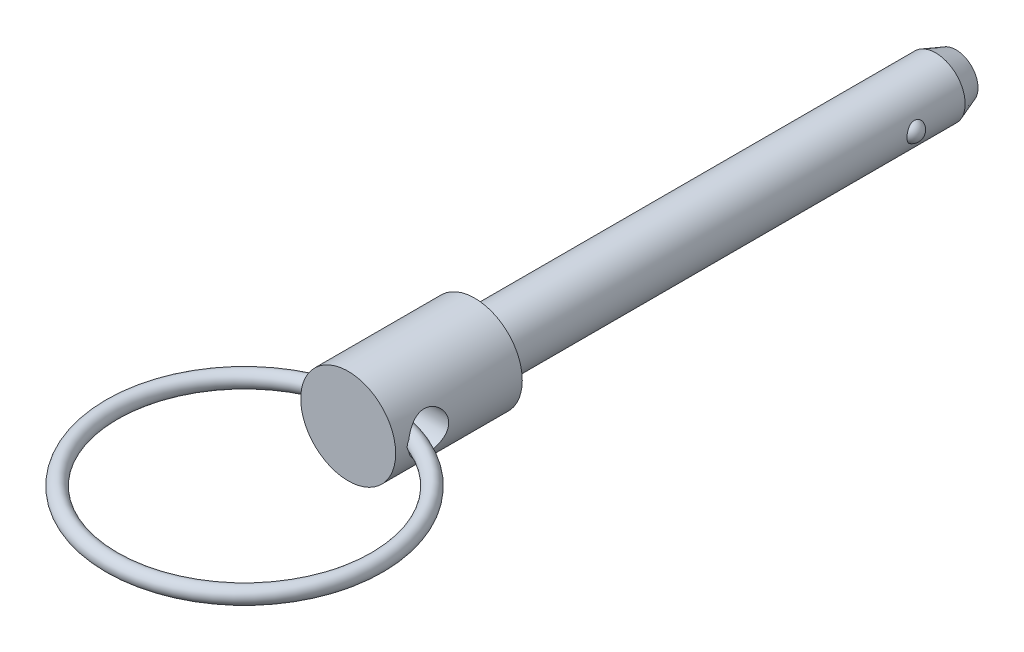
ISO-10303-21;
HEADER;
FILE_DESCRIPTION(('STEP AP214'),'2;1');
FILE_NAME('part.step','',(''),(''),'','','');
FILE_SCHEMA(('AUTOMOTIVE_DESIGN { 1 0 10303 214 1 1 1 1 }'));
ENDSEC;
DATA;
#1=APPLICATION_CONTEXT('core data for automotive mechanical design processes');
#2=APPLICATION_PROTOCOL_DEFINITION('international standard','automotive_design',2000,#1);
#3=PRODUCT_CONTEXT('',#1,'mechanical');
#4=PRODUCT('Part','Part','',(#3));
#5=PRODUCT_RELATED_PRODUCT_CATEGORY('part','',(#4));
#6=PRODUCT_DEFINITION_FORMATION('','',#4);
#7=PRODUCT_DEFINITION_CONTEXT('part definition',#1,'design');
#8=PRODUCT_DEFINITION('design','',#6,#7);
#9=PRODUCT_DEFINITION_SHAPE('','',#8);
#10=(LENGTH_UNIT() NAMED_UNIT(*) SI_UNIT(.MILLI.,.METRE.));
#11=(NAMED_UNIT(*) PLANE_ANGLE_UNIT() SI_UNIT($,.RADIAN.));
#12=(NAMED_UNIT(*) SI_UNIT($,.STERADIAN.) SOLID_ANGLE_UNIT());
#13=UNCERTAINTY_MEASURE_WITH_UNIT(LENGTH_MEASURE(1.E-05),#10,'distance_accuracy_value','');
#14=(GEOMETRIC_REPRESENTATION_CONTEXT(3) GLOBAL_UNCERTAINTY_ASSIGNED_CONTEXT((#13)) GLOBAL_UNIT_ASSIGNED_CONTEXT((#10,
#11,#12)) REPRESENTATION_CONTEXT('',''));
#15=CARTESIAN_POINT('',(0.,0.,0.));
#16=DIRECTION('',(0.,0.,1.));
#17=DIRECTION('',(1.,0.,0.));
#18=AXIS2_PLACEMENT_3D('',#15,#16,#17);
#19=CARTESIAN_POINT('',(6.35,0.,9.398));
#20=DIRECTION('',(-1.,0.,0.));
#21=DIRECTION('',(0.,0.,-1.));
#22=AXIS2_PLACEMENT_3D('',#19,#20,#21);
#23=CYLINDRICAL_SURFACE('',#22,2.0193);
#24=CARTESIAN_POINT('',(-4.76270000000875,0.49815316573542,11.3548893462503));
#25=CARTESIAN_POINT('',(-4.72833190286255,0.47504859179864,11.3607446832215));
#26=CARTESIAN_POINT('',(-4.69505034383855,0.4499197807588,11.3667299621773));
#27=CARTESIAN_POINT('',(-4.63192457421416,0.394832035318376,11.3785339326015));
#28=CARTESIAN_POINT('',(-4.6021351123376,0.364810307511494,11.3843491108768));
#29=CARTESIAN_POINT('',(-4.55535458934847,0.308281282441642,11.3937756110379));
#30=CARTESIAN_POINT('',(-4.53705372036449,0.282907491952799,11.3975656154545));
#31=CARTESIAN_POINT('',(-4.50470768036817,0.229597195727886,11.4043835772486));
#32=CARTESIAN_POINT('',(-4.49064226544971,0.201673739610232,11.4074151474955));
#33=CARTESIAN_POINT('',(-4.46975490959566,0.148629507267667,11.4119668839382));
#34=CARTESIAN_POINT('',(-4.46210314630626,0.123852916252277,11.413657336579));
#35=CARTESIAN_POINT('',(-4.45097170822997,0.0733134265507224,11.4161269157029));
#36=CARTESIAN_POINT('',(-4.44749221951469,0.0475504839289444,11.4169060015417));
#37=CARTESIAN_POINT('',(-4.44500621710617,-0.00425946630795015,11.4174619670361));
#38=CARTESIAN_POINT('',(-4.44600914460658,-0.0303069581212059,11.4172367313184));
#39=CARTESIAN_POINT('',(-4.45241947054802,-0.0818207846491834,11.4158064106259));
#40=CARTESIAN_POINT('',(-4.45782777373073,-0.107286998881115,11.414601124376));
#41=CARTESIAN_POINT('',(-4.4724084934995,-0.156294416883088,11.4113883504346));
#42=CARTESIAN_POINT('',(-4.48147591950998,-0.179868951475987,11.4094032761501));
#43=CARTESIAN_POINT('',(-4.50279050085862,-0.2254541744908,11.404805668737));
#44=CARTESIAN_POINT('',(-4.51503925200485,-0.247464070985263,11.4021928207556));
#45=CARTESIAN_POINT('',(-4.55011891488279,-0.302206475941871,11.394845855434));
#46=CARTESIAN_POINT('',(-4.5749339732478,-0.333621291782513,11.3897686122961));
#47=CARTESIAN_POINT('',(-4.62912866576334,-0.392111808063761,11.3790894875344));
#48=CARTESIAN_POINT('',(-4.65852008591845,-0.419175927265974,11.3734862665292));
#49=CARTESIAN_POINT('',(-4.71307862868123,-0.4633355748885,11.3635175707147));
#50=CARTESIAN_POINT('',(-4.73757440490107,-0.481267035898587,11.3591766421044));
#51=CARTESIAN_POINT('',(-4.76270000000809,-0.498153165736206,11.3548893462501));
#52=B_SPLINE_CURVE_WITH_KNOTS('',3,(#24,#25,#26,#27,#28,#29,#30,#31,#32,#33,#34,#35,#36,#37,#38,
#39,#40,#41,#42,#43,#44,#45,#46,#47,#48,#49,#50,#51),.UNSPECIFIED.,.F.,.F.,(4,2,2,2,2,2,2,2,2,2,
2,2,2,4),(0.,0.125801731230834,0.253367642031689,0.34757949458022,0.441333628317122,
0.518959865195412,0.596589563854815,0.674382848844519,0.752192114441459,0.827911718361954,
0.903669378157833,1.02403641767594,1.14471874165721,1.23653238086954),.UNSPECIFIED.);
#53=CARTESIAN_POINT('',(-4.73813099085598,0.481166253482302,11.3591352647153));
#54=VERTEX_POINT('',#53);
#55=CARTESIAN_POINT('',(-4.73813099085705,-0.481166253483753,11.359135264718));
#56=VERTEX_POINT('',#55);
#57=EDGE_CURVE('E40',#54,#56,#52,.T.);
#58=ORIENTED_EDGE('',*,*,#57,.F.);
#59=CARTESIAN_POINT('',(-4.7625,0.,11.4173));
#60=CARTESIAN_POINT('',(-4.76249489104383,-0.108112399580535,11.4172937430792));
#61=CARTESIAN_POINT('',(-4.75878025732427,-0.216312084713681,11.408574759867));
#62=CARTESIAN_POINT('',(-4.74429807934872,-0.429541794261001,11.3740482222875));
#63=CARTESIAN_POINT('',(-4.73352107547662,-0.534567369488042,11.3482177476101));
#64=CARTESIAN_POINT('',(-4.70606638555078,-0.738151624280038,11.2805979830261));
#65=CARTESIAN_POINT('',(-4.68940628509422,-0.836728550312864,11.2388562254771));
#66=CARTESIAN_POINT('',(-4.65179514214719,-1.02541561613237,11.1408163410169));
#67=CARTESIAN_POINT('',(-4.63084399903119,-1.11552555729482,11.0845178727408));
#68=CARTESIAN_POINT('',(-4.58553515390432,-1.28946876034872,10.9559107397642));
#69=CARTESIAN_POINT('',(-4.56106355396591,-1.37280723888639,10.8829734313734));
#70=CARTESIAN_POINT('',(-4.51195602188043,-1.52649281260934,10.7244940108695));
#71=CARTESIAN_POINT('',(-4.48732001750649,-1.5968337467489,10.6389459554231));
#72=CARTESIAN_POINT('',(-4.43925108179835,-1.72611165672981,10.4523438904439));
#73=CARTESIAN_POINT('',(-4.41594507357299,-1.78427664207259,10.3507188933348));
#74=CARTESIAN_POINT('',(-4.3749946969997,-1.88246618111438,10.1379969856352));
#75=CARTESIAN_POINT('',(-4.35734737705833,-1.92250019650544,10.0269050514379));
#76=CARTESIAN_POINT('',(-4.33095312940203,-1.98122376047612,9.8041136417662));
#77=CARTESIAN_POINT('',(-4.32180970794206,-2.00086973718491,9.69271508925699));
#78=CARTESIAN_POINT('',(-4.31232297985,-2.02124136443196,9.46785625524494));
#79=CARTESIAN_POINT('',(-4.31197457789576,-2.02197796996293,9.35439720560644));
#80=CARTESIAN_POINT('',(-4.31978298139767,-2.00522830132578,9.13832342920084));
#81=CARTESIAN_POINT('',(-4.32726229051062,-1.98919366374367,9.03556669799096));
#82=CARTESIAN_POINT('',(-4.34873498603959,-1.94179810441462,8.83436976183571));
#83=CARTESIAN_POINT('',(-4.36272967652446,-1.91043411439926,8.73593042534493));
#84=CARTESIAN_POINT('',(-4.39597564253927,-1.83265370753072,8.54363008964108));
#85=CARTESIAN_POINT('',(-4.41533413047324,-1.78592620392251,8.44991428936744));
#86=CARTESIAN_POINT('',(-4.45710273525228,-1.67896759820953,8.27128429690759));
#87=CARTESIAN_POINT('',(-4.47951396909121,-1.61873154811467,8.1863733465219));
#88=CARTESIAN_POINT('',(-4.52725353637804,-1.48026834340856,8.0199216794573));
#89=CARTESIAN_POINT('',(-4.55266534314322,-1.40092677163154,7.93932933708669));
#90=CARTESIAN_POINT('',(-4.6018976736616,-1.22958667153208,7.79224755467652));
#91=CARTESIAN_POINT('',(-4.62571737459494,-1.13758167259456,7.72576536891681));
#92=CARTESIAN_POINT('',(-4.66982369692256,-0.940529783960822,7.60732387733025));
#93=CARTESIAN_POINT('',(-4.69000583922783,-0.835212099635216,7.55577397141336));
#94=CARTESIAN_POINT('',(-4.72372878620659,-0.616416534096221,7.47153070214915));
#95=CARTESIAN_POINT('',(-4.73728278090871,-0.502955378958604,7.43879986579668));
#96=CARTESIAN_POINT('',(-4.75192155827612,-0.323662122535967,7.40374908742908));
#97=CARTESIAN_POINT('',(-4.75587275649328,-0.259363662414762,7.39437239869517));
#98=CARTESIAN_POINT('',(-4.76116348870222,-0.130053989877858,7.3818460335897));
#99=CARTESIAN_POINT('',(-4.76250307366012,-0.0650427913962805,7.37869623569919));
#100=CARTESIAN_POINT('',(-4.76249489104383,0.108112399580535,7.37870625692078));
#101=CARTESIAN_POINT('',(-4.75878025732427,0.21631208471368,7.38742524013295));
#102=CARTESIAN_POINT('',(-4.74429807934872,0.429541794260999,7.42195177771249));
#103=CARTESIAN_POINT('',(-4.73352107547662,0.534567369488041,7.44778225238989));
#104=CARTESIAN_POINT('',(-4.70606638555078,0.738151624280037,7.51540201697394));
#105=CARTESIAN_POINT('',(-4.68940628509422,0.836728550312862,7.55714377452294));
#106=CARTESIAN_POINT('',(-4.65179514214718,1.02541561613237,7.65518365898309));
#107=CARTESIAN_POINT('',(-4.63084399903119,1.11552555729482,7.71148212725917));
#108=CARTESIAN_POINT('',(-4.58553515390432,1.28946876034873,7.8400892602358));
#109=CARTESIAN_POINT('',(-4.56106355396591,1.37280723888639,7.91302656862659));
#110=CARTESIAN_POINT('',(-4.51195602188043,1.52649281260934,8.07150598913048));
#111=CARTESIAN_POINT('',(-4.48732001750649,1.5968337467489,8.15705404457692));
#112=CARTESIAN_POINT('',(-4.43925108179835,1.72611165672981,8.34365610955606));
#113=CARTESIAN_POINT('',(-4.41594507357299,1.78427664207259,8.44528110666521));
#114=CARTESIAN_POINT('',(-4.3749946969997,1.88246618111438,8.65800301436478));
#115=CARTESIAN_POINT('',(-4.35734737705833,1.92250019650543,8.76909494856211));
#116=CARTESIAN_POINT('',(-4.33095312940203,1.98122376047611,8.99188635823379));
#117=CARTESIAN_POINT('',(-4.32180970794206,2.00086973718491,9.103284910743));
#118=CARTESIAN_POINT('',(-4.31232297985,2.02124136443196,9.32814374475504));
#119=CARTESIAN_POINT('',(-4.31197457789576,2.02197796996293,9.44160279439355));
#120=CARTESIAN_POINT('',(-4.31978298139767,2.00522830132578,9.65767657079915));
#121=CARTESIAN_POINT('',(-4.32726229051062,1.98919366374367,9.76043330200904));
#122=CARTESIAN_POINT('',(-4.34873498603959,1.94179810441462,9.96163023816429));
#123=CARTESIAN_POINT('',(-4.36272967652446,1.91043411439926,10.0600695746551));
#124=CARTESIAN_POINT('',(-4.39597564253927,1.83265370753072,10.2523699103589));
#125=CARTESIAN_POINT('',(-4.41533413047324,1.78592620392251,10.3460857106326));
#126=CARTESIAN_POINT('',(-4.45710273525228,1.67896759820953,10.5247157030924));
#127=CARTESIAN_POINT('',(-4.47951396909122,1.61873154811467,10.6096266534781));
#128=CARTESIAN_POINT('',(-4.52725353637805,1.48026834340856,10.7760783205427));
#129=CARTESIAN_POINT('',(-4.55266534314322,1.40092677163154,10.8566706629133));
#130=CARTESIAN_POINT('',(-4.6018976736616,1.22958667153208,11.0037524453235));
#131=CARTESIAN_POINT('',(-4.62571737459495,1.13758167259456,11.0702346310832));
#132=CARTESIAN_POINT('',(-4.66982369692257,0.940529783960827,11.1886761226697));
#133=CARTESIAN_POINT('',(-4.69000583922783,0.835212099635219,11.2402260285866));
#134=CARTESIAN_POINT('',(-4.72372878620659,0.616416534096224,11.3244692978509));
#135=CARTESIAN_POINT('',(-4.73728278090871,0.502955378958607,11.3572001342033));
#136=CARTESIAN_POINT('',(-4.75192155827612,0.323662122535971,11.3922509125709));
#137=CARTESIAN_POINT('',(-4.75587275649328,0.259363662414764,11.4016276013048));
#138=CARTESIAN_POINT('',(-4.76116348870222,0.130053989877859,11.4141539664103));
#139=CARTESIAN_POINT('',(-4.76250307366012,0.0650427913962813,11.4173037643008));
#140=CARTESIAN_POINT('',(-4.7625,0.,11.4173));
#141=B_SPLINE_CURVE_WITH_KNOTS('',3,(#59,#60,#61,#62,#63,#64,#65,#66,#67,#68,#69,#70,#71,#72,
#73,#74,#75,#76,#77,#78,#79,#80,#81,#82,#83,#84,#85,#86,#87,#88,#89,#90,#91,#92,#93,#94,#95,#96,
#97,#98,#99,#100,#101,#102,#103,#104,#105,#106,#107,#108,#109,#110,#111,#112,#113,#114,#115,
#116,#117,#118,#119,#120,#121,#122,#123,#124,#125,#126,#127,#128,#129,#130,#131,#132,#133,#134,
#135,#136,#137,#138,#139,#140),.UNSPECIFIED.,.T.,.F.,(4,2,2,2,2,2,2,2,2,2,2,2,2,2,2,2,2,2,2,2,2,
2,2,2,2,2,2,2,2,2,2,2,2,2,2,2,2,2,2,2,4),(0.,0.324084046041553,0.648603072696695,
0.972160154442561,1.29572482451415,1.63451297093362,1.97346129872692,2.32983137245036,
2.68601525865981,3.0246096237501,3.3630078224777,3.67436181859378,3.98577815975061,
4.30393445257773,4.6222074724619,4.96838833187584,5.31474674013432,5.66985671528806,
6.02425711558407,6.21923699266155,6.41421306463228,6.73829711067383,7.06281613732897,
7.38637321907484,7.70993788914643,8.0487260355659,8.38767436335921,8.74404443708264,
9.10022832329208,9.43882268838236,9.77722088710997,10.0885748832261,10.3999912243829,
10.71814751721,11.0364205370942,11.3826013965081,11.7289598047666,12.0840697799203,
12.4384701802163,12.6334500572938,12.8284261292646),.UNSPECIFIED.);
#142=EDGE_CURVE('E54',#56,#54,#141,.T.);
#143=ORIENTED_EDGE('',*,*,#142,.F.);
#144=EDGE_LOOP('',(#58,#143));
#145=FACE_BOUND('',#144,.T.);
#146=CARTESIAN_POINT('',(4.76270000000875,-0.498153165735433,11.3548893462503));
#147=CARTESIAN_POINT('',(4.72833190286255,-0.475048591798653,11.3607446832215));
#148=CARTESIAN_POINT('',(4.69505034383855,-0.449919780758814,11.3667299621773));
#149=CARTESIAN_POINT('',(4.63192457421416,-0.394832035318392,11.3785339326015));
#150=CARTESIAN_POINT('',(4.6021351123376,-0.364810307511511,11.3843491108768));
#151=CARTESIAN_POINT('',(4.55535458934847,-0.30828128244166,11.3937756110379));
#152=CARTESIAN_POINT('',(4.53705372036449,-0.282907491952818,11.3975656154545));
#153=CARTESIAN_POINT('',(4.50470768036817,-0.229597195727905,11.4043835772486));
#154=CARTESIAN_POINT('',(4.49064226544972,-0.20167373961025,11.4074151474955));
#155=CARTESIAN_POINT('',(4.46975490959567,-0.148629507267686,11.4119668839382));
#156=CARTESIAN_POINT('',(4.46210314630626,-0.123852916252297,11.413657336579));
#157=CARTESIAN_POINT('',(4.45097170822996,-0.0733134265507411,11.4161269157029));
#158=CARTESIAN_POINT('',(4.44749221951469,-0.0475504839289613,11.4169060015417));
#159=CARTESIAN_POINT('',(4.44500621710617,0.00425946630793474,11.4174619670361));
#160=CARTESIAN_POINT('',(4.44600914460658,0.0303069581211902,11.4172367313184));
#161=CARTESIAN_POINT('',(4.45241947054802,0.081820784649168,11.4158064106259));
#162=CARTESIAN_POINT('',(4.45782777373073,0.1072869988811,11.414601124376));
#163=CARTESIAN_POINT('',(4.4724084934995,0.156294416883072,11.4113883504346));
#164=CARTESIAN_POINT('',(4.48147591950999,0.17986895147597,11.4094032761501));
#165=CARTESIAN_POINT('',(4.50279050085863,0.225454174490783,11.404805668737));
#166=CARTESIAN_POINT('',(4.51503925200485,0.247464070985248,11.4021928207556));
#167=CARTESIAN_POINT('',(4.55011891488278,0.302206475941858,11.394845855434));
#168=CARTESIAN_POINT('',(4.5749339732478,0.3336212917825,11.3897686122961));
#169=CARTESIAN_POINT('',(4.62912866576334,0.39211180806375,11.3790894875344));
#170=CARTESIAN_POINT('',(4.65852008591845,0.419175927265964,11.3734862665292));
#171=CARTESIAN_POINT('',(4.71307862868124,0.463335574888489,11.3635175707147));
#172=CARTESIAN_POINT('',(4.73757440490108,0.481267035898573,11.3591766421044));
#173=CARTESIAN_POINT('',(4.76270000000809,0.498153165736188,11.3548893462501));
#174=B_SPLINE_CURVE_WITH_KNOTS('',3,(#146,#147,#148,#149,#150,#151,#152,#153,#154,#155,#156,
#157,#158,#159,#160,#161,#162,#163,#164,#165,#166,#167,#168,#169,#170,#171,#172,#173),
.UNSPECIFIED.,.F.,.F.,(4,2,2,2,2,2,2,2,2,2,2,2,2,4),(0.,0.125801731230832,0.253367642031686,
0.347579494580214,0.441333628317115,0.518959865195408,0.596589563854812,0.674382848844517,
0.752192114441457,0.827911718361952,0.90366937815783,1.02403641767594,1.14471874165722,
1.23653238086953),.UNSPECIFIED.);
#175=CARTESIAN_POINT('',(4.73813099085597,-0.481166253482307,11.3591352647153));
#176=VERTEX_POINT('',#175);
#177=CARTESIAN_POINT('',(4.73813099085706,0.481166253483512,11.359135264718));
#178=VERTEX_POINT('',#177);
#179=EDGE_CURVE('E33',#176,#178,#174,.T.);
#180=ORIENTED_EDGE('',*,*,#179,.F.);
#181=CARTESIAN_POINT('',(4.7625,0.,7.3787));
#182=CARTESIAN_POINT('',(4.76249489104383,-0.108112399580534,7.37870625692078));
#183=CARTESIAN_POINT('',(4.75878025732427,-0.216312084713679,7.38742524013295));
#184=CARTESIAN_POINT('',(4.7442980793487,-0.429541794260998,7.42195177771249));
#185=CARTESIAN_POINT('',(4.7335210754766,-0.53456736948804,7.44778225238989));
#186=CARTESIAN_POINT('',(4.70606638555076,-0.738151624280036,7.51540201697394));
#187=CARTESIAN_POINT('',(4.6894062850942,-0.836728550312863,7.55714377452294));
#188=CARTESIAN_POINT('',(4.65179514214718,-1.02541561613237,7.65518365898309));
#189=CARTESIAN_POINT('',(4.63084399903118,-1.11552555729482,7.71148212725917));
#190=CARTESIAN_POINT('',(4.58553515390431,-1.28946876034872,7.8400892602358));
#191=CARTESIAN_POINT('',(4.5610635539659,-1.37280723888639,7.91302656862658));
#192=CARTESIAN_POINT('',(4.51195602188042,-1.52649281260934,8.07150598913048));
#193=CARTESIAN_POINT('',(4.48732001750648,-1.59683374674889,8.15705404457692));
#194=CARTESIAN_POINT('',(4.43925108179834,-1.7261116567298,8.34365610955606));
#195=CARTESIAN_POINT('',(4.41594507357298,-1.78427664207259,8.44528110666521));
#196=CARTESIAN_POINT('',(4.37499469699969,-1.88246618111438,8.65800301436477));
#197=CARTESIAN_POINT('',(4.35734737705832,-1.92250019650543,8.76909494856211));
#198=CARTESIAN_POINT('',(4.33095312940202,-1.98122376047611,8.99188635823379));
#199=CARTESIAN_POINT('',(4.32180970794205,-2.0008697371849,9.103284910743));
#200=CARTESIAN_POINT('',(4.31232297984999,-2.02124136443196,9.32814374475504));
#201=CARTESIAN_POINT('',(4.31197457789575,-2.02197796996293,9.44160279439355));
#202=CARTESIAN_POINT('',(4.31978298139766,-2.00522830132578,9.65767657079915));
#203=CARTESIAN_POINT('',(4.3272622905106,-1.98919366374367,9.76043330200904));
#204=CARTESIAN_POINT('',(4.34873498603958,-1.94179810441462,9.96163023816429));
#205=CARTESIAN_POINT('',(4.36272967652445,-1.91043411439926,10.0600695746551));
#206=CARTESIAN_POINT('',(4.39597564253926,-1.83265370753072,10.2523699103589));
#207=CARTESIAN_POINT('',(4.41533413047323,-1.78592620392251,10.3460857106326));
#208=CARTESIAN_POINT('',(4.45710273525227,-1.67896759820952,10.5247157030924));
#209=CARTESIAN_POINT('',(4.4795139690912,-1.61873154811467,10.6096266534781));
#210=CARTESIAN_POINT('',(4.52725353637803,-1.48026834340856,10.7760783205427));
#211=CARTESIAN_POINT('',(4.55266534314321,-1.40092677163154,10.8566706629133));
#212=CARTESIAN_POINT('',(4.60189767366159,-1.22958667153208,11.0037524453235));
#213=CARTESIAN_POINT('',(4.62571737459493,-1.13758167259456,11.0702346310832));
#214=CARTESIAN_POINT('',(4.66982369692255,-0.940529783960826,11.1886761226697));
#215=CARTESIAN_POINT('',(4.69000583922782,-0.835212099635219,11.2402260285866));
#216=CARTESIAN_POINT('',(4.72372878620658,-0.616416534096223,11.3244692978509));
#217=CARTESIAN_POINT('',(4.7372827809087,-0.502955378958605,11.3572001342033));
#218=CARTESIAN_POINT('',(4.7519215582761,-0.323662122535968,11.3922509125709));
#219=CARTESIAN_POINT('',(4.75587275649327,-0.259363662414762,11.4016276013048));
#220=CARTESIAN_POINT('',(4.76116348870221,-0.130053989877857,11.4141539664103));
#221=CARTESIAN_POINT('',(4.76250307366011,-0.0650427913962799,11.4173037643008));
#222=CARTESIAN_POINT('',(4.76249489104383,0.108112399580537,11.4172937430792));
#223=CARTESIAN_POINT('',(4.75878025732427,0.216312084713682,11.408574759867));
#224=CARTESIAN_POINT('',(4.7442980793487,0.429541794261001,11.3740482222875));
#225=CARTESIAN_POINT('',(4.7335210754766,0.534567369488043,11.3482177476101));
#226=CARTESIAN_POINT('',(4.70606638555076,0.738151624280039,11.2805979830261));
#227=CARTESIAN_POINT('',(4.6894062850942,0.836728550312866,11.2388562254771));
#228=CARTESIAN_POINT('',(4.65179514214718,1.02541561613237,11.1408163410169));
#229=CARTESIAN_POINT('',(4.63084399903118,1.11552555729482,11.0845178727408));
#230=CARTESIAN_POINT('',(4.58553515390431,1.28946876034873,10.9559107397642));
#231=CARTESIAN_POINT('',(4.5610635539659,1.37280723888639,10.8829734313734));
#232=CARTESIAN_POINT('',(4.51195602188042,1.52649281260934,10.7244940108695));
#233=CARTESIAN_POINT('',(4.48732001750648,1.5968337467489,10.6389459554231));
#234=CARTESIAN_POINT('',(4.43925108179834,1.72611165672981,10.4523438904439));
#235=CARTESIAN_POINT('',(4.41594507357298,1.78427664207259,10.3507188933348));
#236=CARTESIAN_POINT('',(4.37499469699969,1.88246618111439,10.1379969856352));
#237=CARTESIAN_POINT('',(4.35734737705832,1.92250019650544,10.0269050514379));
#238=CARTESIAN_POINT('',(4.33095312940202,1.98122376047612,9.8041136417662));
#239=CARTESIAN_POINT('',(4.32180970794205,2.00086973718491,9.69271508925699));
#240=CARTESIAN_POINT('',(4.31232297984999,2.02124136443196,9.46785625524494));
#241=CARTESIAN_POINT('',(4.31197457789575,2.02197796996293,9.35439720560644));
#242=CARTESIAN_POINT('',(4.31978298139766,2.00522830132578,9.13832342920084));
#243=CARTESIAN_POINT('',(4.32726229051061,1.98919366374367,9.03556669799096));
#244=CARTESIAN_POINT('',(4.34873498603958,1.94179810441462,8.83436976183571));
#245=CARTESIAN_POINT('',(4.36272967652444,1.91043411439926,8.73593042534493));
#246=CARTESIAN_POINT('',(4.39597564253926,1.83265370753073,8.54363008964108));
#247=CARTESIAN_POINT('',(4.41533413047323,1.78592620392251,8.44991428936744));
#248=CARTESIAN_POINT('',(4.45710273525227,1.67896759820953,8.27128429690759));
#249=CARTESIAN_POINT('',(4.4795139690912,1.61873154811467,8.1863733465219));
#250=CARTESIAN_POINT('',(4.52725353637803,1.48026834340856,8.0199216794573));
#251=CARTESIAN_POINT('',(4.55266534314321,1.40092677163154,7.93932933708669));
#252=CARTESIAN_POINT('',(4.60189767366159,1.22958667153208,7.79224755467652));
#253=CARTESIAN_POINT('',(4.62571737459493,1.13758167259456,7.72576536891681));
#254=CARTESIAN_POINT('',(4.66982369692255,0.940529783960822,7.60732387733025));
#255=CARTESIAN_POINT('',(4.69000583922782,0.835212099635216,7.55577397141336));
#256=CARTESIAN_POINT('',(4.72372878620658,0.616416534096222,7.47153070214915));
#257=CARTESIAN_POINT('',(4.7372827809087,0.502955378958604,7.43879986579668));
#258=CARTESIAN_POINT('',(4.7519215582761,0.323662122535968,7.40374908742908));
#259=CARTESIAN_POINT('',(4.75587275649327,0.259363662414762,7.39437239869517));
#260=CARTESIAN_POINT('',(4.76116348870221,0.130053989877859,7.3818460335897));
#261=CARTESIAN_POINT('',(4.76250307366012,0.0650427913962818,7.37869623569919));
#262=CARTESIAN_POINT('',(4.7625,0.,7.3787));
#263=B_SPLINE_CURVE_WITH_KNOTS('',3,(#181,#182,#183,#184,#185,#186,#187,#188,#189,#190,#191,
#192,#193,#194,#195,#196,#197,#198,#199,#200,#201,#202,#203,#204,#205,#206,#207,#208,#209,#210,
#211,#212,#213,#214,#215,#216,#217,#218,#219,#220,#221,#222,#223,#224,#225,#226,#227,#228,#229,
#230,#231,#232,#233,#234,#235,#236,#237,#238,#239,#240,#241,#242,#243,#244,#245,#246,#247,#248,
#249,#250,#251,#252,#253,#254,#255,#256,#257,#258,#259,#260,#261,#262),.UNSPECIFIED.,.T.,.F.,(4,
2,2,2,2,2,2,2,2,2,2,2,2,2,2,2,2,2,2,2,2,2,2,2,2,2,2,2,2,2,2,2,2,2,2,2,2,2,2,2,4),(0.,
0.324084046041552,0.648603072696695,0.972160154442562,1.29572482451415,1.63451297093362,
1.97346129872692,2.32983137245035,2.6860152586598,3.02460962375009,3.36300782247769,
3.67436181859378,3.98577815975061,4.30393445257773,4.6222074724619,4.96838833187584,
5.31474674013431,5.66985671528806,6.02425711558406,6.21923699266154,6.41421306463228,
6.73829711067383,7.06281613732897,7.38637321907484,7.70993788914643,8.0487260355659,
8.3876743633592,8.74404443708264,9.10022832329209,9.43882268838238,9.77722088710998,
10.0885748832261,10.3999912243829,10.71814751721,11.0364205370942,11.3826013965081,
11.7289598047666,12.0840697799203,12.4384701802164,12.6334500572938,12.8284261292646),.UNSPECIFIED.);
#264=EDGE_CURVE('E50',#178,#176,#263,.T.);
#265=ORIENTED_EDGE('',*,*,#264,.F.);
#266=EDGE_LOOP('',(#180,#265));
#267=FACE_BOUND('',#266,.T.);
#268=ADVANCED_FACE('F14',(#145,#267),#23,.F.);
#269=CARTESIAN_POINT('',(0.,0.,-23.2664));
#270=DIRECTION('',(0.,0.,-1.));
#271=DIRECTION('',(1.,0.,0.));
#272=AXIS2_PLACEMENT_3D('',#269,#270,#271);
#273=CYLINDRICAL_SURFACE('',#272,4.7625);
#274=ORIENTED_EDGE('',*,*,#264,.T.);
#275=CARTESIAN_POINT('',(4.75672783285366,-0.234410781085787,9.86389096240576));
#276=CARTESIAN_POINT('',(4.75463715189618,-0.276823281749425,9.87695364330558));
#277=CARTESIAN_POINT('',(4.75202741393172,-0.318142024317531,9.89358560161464));
#278=CARTESIAN_POINT('',(4.74605906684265,-0.397384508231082,9.93354154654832));
#279=CARTESIAN_POINT('',(4.74269965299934,-0.435304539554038,9.95687273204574));
#280=CARTESIAN_POINT('',(4.7356117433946,-0.506628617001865,10.0095466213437));
#281=CARTESIAN_POINT('',(4.731883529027,-0.540036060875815,10.0388847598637));
#282=CARTESIAN_POINT('',(4.72446904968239,-0.601463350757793,10.1027270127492));
#283=CARTESIAN_POINT('',(4.72078277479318,-0.629484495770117,10.1372298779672));
#284=CARTESIAN_POINT('',(4.71381973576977,-0.679675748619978,10.2106969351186));
#285=CARTESIAN_POINT('',(4.71054647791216,-0.701797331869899,10.2496945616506));
#286=CARTESIAN_POINT('',(4.70478201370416,-0.739457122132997,10.3307970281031));
#287=CARTESIAN_POINT('',(4.7022909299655,-0.754994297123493,10.3729023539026));
#288=CARTESIAN_POINT('',(4.69825743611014,-0.779709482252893,10.4605198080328));
#289=CARTESIAN_POINT('',(4.69674995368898,-0.788654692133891,10.5060989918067));
#290=CARTESIAN_POINT('',(4.694941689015,-0.799348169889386,10.5981124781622));
#291=CARTESIAN_POINT('',(4.69464124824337,-0.80109440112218,10.6445470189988));
#292=CARTESIAN_POINT('',(4.69525593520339,-0.797484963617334,10.7400273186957));
#293=CARTESIAN_POINT('',(4.6962479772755,-0.7916799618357,10.7890554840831));
#294=CARTESIAN_POINT('',(4.69943436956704,-0.772538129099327,10.88558205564));
#295=CARTESIAN_POINT('',(4.70162918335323,-0.759198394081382,10.9330798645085));
#296=CARTESIAN_POINT('',(4.7071366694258,-0.724294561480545,11.0283694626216));
#297=CARTESIAN_POINT('',(4.71051187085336,-0.702258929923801,11.0759856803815));
#298=CARTESIAN_POINT('',(4.71792781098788,-0.650571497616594,11.1668661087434));
#299=CARTESIAN_POINT('',(4.72196879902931,-0.620916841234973,11.2101286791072));
#300=CARTESIAN_POINT('',(4.73024120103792,-0.554392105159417,11.2909794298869));
#301=CARTESIAN_POINT('',(4.73447324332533,-0.517496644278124,11.3285468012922));
#302=CARTESIAN_POINT('',(4.74255290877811,-0.437280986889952,11.3961281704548));
#303=CARTESIAN_POINT('',(4.74640083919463,-0.393965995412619,11.4261482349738));
#304=CARTESIAN_POINT('',(4.75279848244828,-0.306647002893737,11.4743172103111));
#305=CARTESIAN_POINT('',(4.7554392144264,-0.263139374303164,11.4933494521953));
#306=CARTESIAN_POINT('',(4.75956072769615,-0.17321041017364,11.5225838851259));
#307=CARTESIAN_POINT('',(4.7610430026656,-0.126792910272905,11.5327974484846));
#308=CARTESIAN_POINT('',(4.76251214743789,-0.0392228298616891,11.5429046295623));
#309=CARTESIAN_POINT('',(4.76267454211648,0.00179015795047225,11.5440098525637));
#310=CARTESIAN_POINT('',(4.76194485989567,0.0833582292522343,11.5390051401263));
#311=CARTESIAN_POINT('',(4.76105302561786,0.123913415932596,11.5328968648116));
#312=CARTESIAN_POINT('',(4.75839052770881,0.20139070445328,11.5143023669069));
#313=CARTESIAN_POINT('',(4.75666474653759,0.238393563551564,11.5021410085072));
#314=CARTESIAN_POINT('',(4.75253498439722,0.310009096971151,11.4722173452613));
#315=CARTESIAN_POINT('',(4.75013086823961,0.344621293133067,11.4544539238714));
#316=CARTESIAN_POINT('',(4.74468244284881,0.413106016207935,11.4126354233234));
#317=CARTESIAN_POINT('',(4.74160529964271,0.446760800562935,11.3882294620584));
#318=CARTESIAN_POINT('',(4.73521429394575,0.510064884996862,11.3347169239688));
#319=CARTESIAN_POINT('',(4.73190032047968,0.53971228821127,11.3056081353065));
#320=CARTESIAN_POINT('',(4.72489226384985,0.598141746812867,11.2395451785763));
#321=CARTESIAN_POINT('',(4.72120374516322,0.626328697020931,11.2020637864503));
#322=CARTESIAN_POINT('',(4.71424234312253,0.676737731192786,11.1232450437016));
#323=CARTESIAN_POINT('',(4.71096968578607,0.698956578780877,11.0819056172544));
#324=CARTESIAN_POINT('',(4.70485086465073,0.739081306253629,10.9918449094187));
#325=CARTESIAN_POINT('',(4.70208579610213,0.756287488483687,10.9428045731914));
#326=CARTESIAN_POINT('',(4.69779376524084,0.782507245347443,10.8425158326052));
#327=CARTESIAN_POINT('',(4.69626707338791,0.79151903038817,10.7912669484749));
#328=CARTESIAN_POINT('',(4.69466144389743,0.80099052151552,10.6869325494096));
#329=CARTESIAN_POINT('',(4.69461132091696,0.801280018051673,10.6338307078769));
#330=CARTESIAN_POINT('',(4.69610058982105,0.792506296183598,10.5284214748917));
#331=CARTESIAN_POINT('',(4.69763938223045,0.783446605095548,10.4761137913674));
#332=CARTESIAN_POINT('',(4.70202301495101,0.756674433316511,10.3770218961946));
#333=CARTESIAN_POINT('',(4.70478816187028,0.739486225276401,10.3300928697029));
#334=CARTESIAN_POINT('',(4.71127399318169,0.696967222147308,10.2401511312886));
#335=CARTESIAN_POINT('',(4.71499427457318,0.671639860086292,10.1971367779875));
#336=CARTESIAN_POINT('',(4.72264431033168,0.615452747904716,10.1192841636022));
#337=CARTESIAN_POINT('',(4.72654308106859,0.585080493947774,10.0840903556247));
#338=CARTESIAN_POINT('',(4.73429341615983,0.51863947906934,10.0195645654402));
#339=CARTESIAN_POINT('',(4.73814499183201,0.482572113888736,9.99023115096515));
#340=CARTESIAN_POINT('',(4.74520575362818,0.407195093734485,9.93927752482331));
#341=CARTESIAN_POINT('',(4.74843306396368,0.368048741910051,9.91741780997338));
#342=CARTESIAN_POINT('',(4.75404590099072,0.286564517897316,9.88060848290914));
#343=CARTESIAN_POINT('',(4.75643129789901,0.24422615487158,9.86565993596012));
#344=CARTESIAN_POINT('',(4.76007108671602,0.158026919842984,9.8432015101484));
#345=CARTESIAN_POINT('',(4.76133640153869,0.114185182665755,9.8356197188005));
#346=CARTESIAN_POINT('',(4.76263391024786,0.0258666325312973,9.82784590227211));
#347=CARTESIAN_POINT('',(4.76266746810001,-0.0186094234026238,9.82764570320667));
#348=CARTESIAN_POINT('',(4.76170334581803,-0.0918724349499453,9.83342133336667));
#349=CARTESIAN_POINT('',(4.76105293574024,-0.120844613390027,9.83731729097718));
#350=CARTESIAN_POINT('',(4.75925240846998,-0.178172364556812,9.84825826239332));
#351=CARTESIAN_POINT('',(4.7581022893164,-0.206527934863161,9.85530328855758));
#352=CARTESIAN_POINT('',(4.75672783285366,-0.234410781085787,9.86389096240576));
#353=B_SPLINE_CURVE_WITH_KNOTS('',3,(#275,#276,#277,#278,#279,#280,#281,#282,#283,#284,#285,
#286,#287,#288,#289,#290,#291,#292,#293,#294,#295,#296,#297,#298,#299,#300,#301,#302,#303,#304,
#305,#306,#307,#308,#309,#310,#311,#312,#313,#314,#315,#316,#317,#318,#319,#320,#321,#322,#323,
#324,#325,#326,#327,#328,#329,#330,#331,#332,#333,#334,#335,#336,#337,#338,#339,#340,#341,#342,
#343,#344,#345,#346,#347,#348,#349,#350,#351,#352),.UNSPECIFIED.,.T.,.F.,(4,2,2,2,2,2,2,2,2,2,2,
2,2,2,2,2,2,2,2,2,2,2,2,2,2,2,2,2,2,2,2,2,2,2,2,2,2,2,4),(0.,0.133176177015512,
0.266496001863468,0.3997148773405,0.532901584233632,0.667152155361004,0.801423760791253,
0.940235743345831,1.07908699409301,1.2265907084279,1.37415131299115,1.53115159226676,
1.68821080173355,1.84583071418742,2.00332351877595,2.14516294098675,2.28681917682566,
2.4092664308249,2.53168551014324,2.64814679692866,2.76463131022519,2.88919364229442,
3.01381473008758,3.15436663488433,3.2949946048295,3.45041783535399,3.60587500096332,
3.76436388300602,3.92279299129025,4.07216500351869,4.22147409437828,4.36072714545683,
4.49994612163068,4.63415709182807,4.76838874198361,4.90129648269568,5.03405704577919,
5.12160944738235,5.20916219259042),.UNSPECIFIED.);
#354=EDGE_CURVE('E27',#176,#178,#353,.T.);
#355=ORIENTED_EDGE('',*,*,#354,.T.);
#356=EDGE_LOOP('',(#274,#355));
#357=FACE_BOUND('',#356,.T.);
#358=CARTESIAN_POINT('',(0.,0.,1.14006026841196E-11));
#359=DIRECTION('',(0.,0.,-1.));
#360=DIRECTION('',(1.,0.,0.));
#361=AXIS2_PLACEMENT_3D('',#358,#359,#360);
#362=CIRCLE('',#361,4.76249999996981);
#363=CARTESIAN_POINT('',(4.76249999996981,0.,1.14003927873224E-11));
#364=VERTEX_POINT('',#363);
#365=EDGE_CURVE('E59',#364,#364,#362,.T.);
#366=ORIENTED_EDGE('',*,*,#365,.F.);
#367=EDGE_LOOP('',(#366));
#368=FACE_BOUND('',#367,.T.);
#369=CARTESIAN_POINT('',(0.,0.,12.7000000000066));
#370=DIRECTION('',(0.,0.,-1.));
#371=DIRECTION('',(1.,0.,0.));
#372=AXIS2_PLACEMENT_3D('',#369,#370,#371);
#373=CIRCLE('',#372,4.76249999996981);
#374=CARTESIAN_POINT('',(4.7624999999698,0.,12.7000000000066));
#375=VERTEX_POINT('',#374);
#376=EDGE_CURVE('E135',#375,#375,#373,.T.);
#377=ORIENTED_EDGE('',*,*,#376,.T.);
#378=EDGE_LOOP('',(#377));
#379=FACE_BOUND('',#378,.T.);
#380=ORIENTED_EDGE('',*,*,#142,.T.);
#381=CARTESIAN_POINT('',(-4.75672783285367,-0.234410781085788,9.86389096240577));
#382=CARTESIAN_POINT('',(-4.75880797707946,-0.192184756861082,9.85088943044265));
#383=CARTESIAN_POINT('',(-4.76037619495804,-0.148820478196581,9.84140883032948));
#384=CARTESIAN_POINT('',(-4.76231114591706,-0.0610623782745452,9.8297605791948));
#385=CARTESIAN_POINT('',(-4.76267662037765,-0.0166675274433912,9.82760058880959));
#386=CARTESIAN_POINT('',(-4.76216356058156,0.07184476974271,9.83066350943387));
#387=CARTESIAN_POINT('',(-4.76128553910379,0.115962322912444,9.83588337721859));
#388=CARTESIAN_POINT('',(-4.75838343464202,0.2026716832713,9.85356395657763));
#389=CARTESIAN_POINT('',(-4.75635960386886,0.245263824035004,9.86602307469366));
#390=CARTESIAN_POINT('',(-4.75138989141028,0.327732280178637,9.89785096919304));
#391=CARTESIAN_POINT('',(-4.7484438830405,0.367608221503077,9.91722069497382));
#392=CARTESIAN_POINT('',(-4.74195662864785,0.443516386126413,9.96233891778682));
#393=CARTESIAN_POINT('',(-4.73841538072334,0.479548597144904,9.98808743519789));
#394=CARTESIAN_POINT('',(-4.73111995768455,0.54686530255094,10.0453065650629));
#395=CARTESIAN_POINT('',(-4.72736528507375,0.578138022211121,10.0767909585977));
#396=CARTESIAN_POINT('',(-4.72006096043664,0.635024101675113,10.1445276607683));
#397=CARTESIAN_POINT('',(-4.71651131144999,0.660637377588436,10.1807800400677));
#398=CARTESIAN_POINT('',(-4.70994476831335,0.705946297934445,10.2575433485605));
#399=CARTESIAN_POINT('',(-4.70693606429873,0.725553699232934,10.298106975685));
#400=CARTESIAN_POINT('',(-4.70181675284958,0.758021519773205,10.3818966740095));
#401=CARTESIAN_POINT('',(-4.69970628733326,0.770880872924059,10.4251231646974));
#402=CARTESIAN_POINT('',(-4.69650867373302,0.790134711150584,10.5148288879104));
#403=CARTESIAN_POINT('',(-4.69546563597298,0.796251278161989,10.5613691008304));
#404=CARTESIAN_POINT('',(-4.69462220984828,0.801207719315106,10.6548424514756));
#405=CARTESIAN_POINT('',(-4.69482220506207,0.800045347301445,10.7017757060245));
#406=CARTESIAN_POINT('',(-4.69645733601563,0.790392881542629,10.7979976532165));
#407=CARTESIAN_POINT('',(-4.69797327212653,0.781423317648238,10.8472368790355));
#408=CARTESIAN_POINT('',(-4.70214662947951,0.755902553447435,10.943667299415));
#409=CARTESIAN_POINT('',(-4.70480451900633,0.739348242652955,10.9908576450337));
#410=CARTESIAN_POINT('',(-4.71113533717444,0.697907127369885,11.0846488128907));
#411=CARTESIAN_POINT('',(-4.71485784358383,0.672595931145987,11.1310597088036));
#412=CARTESIAN_POINT('',(-4.72278864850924,0.614436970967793,11.2188860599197));
#413=CARTESIAN_POINT('',(-4.72699707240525,0.5815872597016,11.2603002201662));
#414=CARTESIAN_POINT('',(-4.73530162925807,0.50952624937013,11.3359421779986));
#415=CARTESIAN_POINT('',(-4.73939847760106,0.470426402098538,11.3702753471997));
#416=CARTESIAN_POINT('',(-4.74699023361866,0.386343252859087,11.4308675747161));
#417=CARTESIAN_POINT('',(-4.75048579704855,0.341366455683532,11.457135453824));
#418=CARTESIAN_POINT('',(-4.7559922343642,0.252376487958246,11.4974010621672));
#419=CARTESIAN_POINT('',(-4.75812829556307,0.208856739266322,11.5124686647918));
#420=CARTESIAN_POINT('',(-4.76120337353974,0.119700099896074,11.5339491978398));
#421=CARTESIAN_POINT('',(-4.76214369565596,0.0740655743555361,11.540371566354));
#422=CARTESIAN_POINT('',(-4.76265411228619,-0.0117455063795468,11.54386707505));
#423=CARTESIAN_POINT('',(-4.7623828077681,-0.0518805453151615,11.5420222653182));
#424=CARTESIAN_POINT('',(-4.76085712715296,-0.131220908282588,11.531508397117));
#425=CARTESIAN_POINT('',(-4.75960284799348,-0.170426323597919,11.5228400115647));
#426=CARTESIAN_POINT('',(-4.75629335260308,-0.245921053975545,11.499439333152));
#427=CARTESIAN_POINT('',(-4.75425749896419,-0.282257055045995,11.4848531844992));
#428=CARTESIAN_POINT('',(-4.74958711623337,-0.352221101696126,11.4503009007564));
#429=CARTESIAN_POINT('',(-4.74695243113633,-0.385848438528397,11.4303333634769));
#430=CARTESIAN_POINT('',(-4.74107206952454,-0.452616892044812,11.3838151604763));
#431=CARTESIAN_POINT('',(-4.73779315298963,-0.485460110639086,11.3568423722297));
#432=CARTESIAN_POINT('',(-4.73110830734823,-0.546785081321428,11.2983457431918));
#433=CARTESIAN_POINT('',(-4.72770231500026,-0.575264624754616,11.2668196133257));
#434=CARTESIAN_POINT('',(-4.72061927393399,-0.630909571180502,11.1957249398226));
#435=CARTESIAN_POINT('',(-4.71696449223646,-0.657423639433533,11.1556436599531));
#436=CARTESIAN_POINT('',(-4.7102323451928,-0.704040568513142,11.071860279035));
#437=CARTESIAN_POINT('',(-4.70715528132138,-0.724140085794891,11.0281563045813));
#438=CARTESIAN_POINT('',(-4.70165375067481,-0.759079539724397,10.9340419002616));
#439=CARTESIAN_POINT('',(-4.69931471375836,-0.773270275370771,10.8833836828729));
#440=CARTESIAN_POINT('',(-4.69601325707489,-0.793074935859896,10.7803615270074));
#441=CARTESIAN_POINT('',(-4.69505096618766,-0.798688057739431,10.7279974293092));
#442=CARTESIAN_POINT('',(-4.69467378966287,-0.80090376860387,10.6230225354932));
#443=CARTESIAN_POINT('',(-4.69525980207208,-0.797501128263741,10.5704116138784));
#444=CARTESIAN_POINT('',(-4.69796643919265,-0.781399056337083,10.4666696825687));
#445=CARTESIAN_POINT('',(-4.70008633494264,-0.768704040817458,10.4155379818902));
#446=CARTESIAN_POINT('',(-4.70543825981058,-0.735202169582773,10.3197920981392));
#447=CARTESIAN_POINT('',(-4.70858907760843,-0.714975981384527,10.2749703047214));
#448=CARTESIAN_POINT('',(-4.71564813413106,-0.666826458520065,10.189721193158));
#449=CARTESIAN_POINT('',(-4.71955625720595,-0.638904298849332,10.1492932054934));
#450=CARTESIAN_POINT('',(-4.72737726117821,-0.578090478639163,10.0766022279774));
#451=CARTESIAN_POINT('',(-4.73127475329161,-0.545615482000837,10.0439879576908));
#452=CARTESIAN_POINT('',(-4.73883375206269,-0.475496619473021,9.98491901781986));
#453=CARTESIAN_POINT('',(-4.74249555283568,-0.43785938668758,9.95845655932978));
#454=CARTESIAN_POINT('',(-4.74798881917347,-0.37240054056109,9.92049627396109));
#455=CARTESIAN_POINT('',(-4.75001326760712,-0.345732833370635,9.90699794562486));
#456=CARTESIAN_POINT('',(-4.7536791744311,-0.291020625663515,9.88309301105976));
#457=CARTESIAN_POINT('',(-4.7553206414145,-0.262976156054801,9.87268633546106));
#458=CARTESIAN_POINT('',(-4.75672783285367,-0.234410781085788,9.86389096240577));
#459=B_SPLINE_CURVE_WITH_KNOTS('',3,(#381,#382,#383,#384,#385,#386,#387,#388,#389,#390,#391,
#392,#393,#394,#395,#396,#397,#398,#399,#400,#401,#402,#403,#404,#405,#406,#407,#408,#409,#410,
#411,#412,#413,#414,#415,#416,#417,#418,#419,#420,#421,#422,#423,#424,#425,#426,#427,#428,#429,
#430,#431,#432,#433,#434,#435,#436,#437,#438,#439,#440,#441,#442,#443,#444,#445,#446,#447,#448,
#449,#450,#451,#452,#453,#454,#455,#456,#457,#458),.UNSPECIFIED.,.T.,.F.,(4,2,2,2,2,2,2,2,2,2,2,
2,2,2,2,2,2,2,2,2,2,2,2,2,2,2,2,2,2,2,2,2,2,2,2,2,2,2,4),(0.,0.132584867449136,
0.265308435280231,0.397977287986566,0.530616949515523,0.663274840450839,0.795933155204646,
0.928914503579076,1.06189782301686,1.1967504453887,1.33162436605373,1.47187070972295,
1.6121603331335,1.76172674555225,1.91135454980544,2.06958609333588,2.22785855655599,
2.38357184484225,2.53911422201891,2.67661376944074,2.81396308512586,2.93389956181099,
3.05382421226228,3.17095185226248,3.28811004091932,3.41548078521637,3.54291578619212,
3.68690552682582,3.8309701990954,3.98821148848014,4.14546749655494,4.30281473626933,
4.46008724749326,4.60714088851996,4.75417209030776,4.89206605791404,5.02978447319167,
5.11947848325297,5.20917048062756),.UNSPECIFIED.);
#460=EDGE_CURVE('E9',#54,#56,#459,.T.);
#461=ORIENTED_EDGE('',*,*,#460,.T.);
#462=EDGE_LOOP('',(#380,#461));
#463=FACE_BOUND('',#462,.T.);
#464=ADVANCED_FACE('F52',(#357,#368,#379,#463),#273,.T.);
#465=CARTESIAN_POINT('',(0.,0.,-25.));
#466=DIRECTION('',(0.,0.,1.));
#467=DIRECTION('',(-0.810321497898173,-0.585985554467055,0.));
#468=AXIS2_PLACEMENT_3D('',#465,#466,#467);
#469=CYLINDRICAL_SURFACE('',#468,2.95529);
#470=CARTESIAN_POINT('',(0.,0.,0.));
#471=DIRECTION('',(0.,0.,-1.));
#472=DIRECTION('',(0.810321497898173,0.585985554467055,0.));
#473=AXIS2_PLACEMENT_3D('',#470,#471,#472);
#474=CIRCLE('',#473,2.95529);
#475=CARTESIAN_POINT('',(2.39473501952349,1.73175724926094,0.));
#476=VERTEX_POINT('',#475);
#477=EDGE_CURVE('E48',#476,#476,#474,.T.);
#478=ORIENTED_EDGE('',*,*,#477,.T.);
#479=EDGE_LOOP('',(#478));
#480=FACE_BOUND('',#479,.T.);
#481=CARTESIAN_POINT('',(-2.95529,0.,-42.1918269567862));
#482=CARTESIAN_POINT('',(-2.95528983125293,0.0550926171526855,-42.1918267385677));
#483=CARTESIAN_POINT('',(-2.95373607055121,0.11018694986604,-42.1874652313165));
#484=CARTESIAN_POINT('',(-2.94767937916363,0.218829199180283,-42.1700859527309));
#485=CARTESIAN_POINT('',(-2.94317634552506,0.272377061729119,-42.1570678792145));
#486=CARTESIAN_POINT('',(-2.93168588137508,0.37642934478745,-42.1225739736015));
#487=CARTESIAN_POINT('',(-2.92469717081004,0.426932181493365,-42.1010937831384));
#488=CARTESIAN_POINT('',(-2.90898593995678,0.523382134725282,-42.0500375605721));
#489=CARTESIAN_POINT('',(-2.900263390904,0.569329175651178,-42.0204613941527));
#490=CARTESIAN_POINT('',(-2.88219034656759,0.654674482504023,-41.9542064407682));
#491=CARTESIAN_POINT('',(-2.87284943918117,0.694149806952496,-41.9176245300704));
#492=CARTESIAN_POINT('',(-2.8545494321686,0.765938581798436,-41.8379086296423));
#493=CARTESIAN_POINT('',(-2.84559022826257,0.7982539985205,-41.7947764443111));
#494=CARTESIAN_POINT('',(-2.82961358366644,0.853114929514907,-41.7053619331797));
#495=CARTESIAN_POINT('',(-2.82252187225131,0.876065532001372,-41.6593419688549));
#496=CARTESIAN_POINT('',(-2.81062752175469,0.913510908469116,-41.5637072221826));
#497=CARTESIAN_POINT('',(-2.80582362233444,0.928010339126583,-41.5140944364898));
#498=CARTESIAN_POINT('',(-2.79938954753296,0.947234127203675,-41.4165034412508));
#499=CARTESIAN_POINT('',(-2.79755758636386,0.952581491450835,-41.3686607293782));
#500=CARTESIAN_POINT('',(-2.79664698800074,0.955252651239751,-41.2727309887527));
#501=CARTESIAN_POINT('',(-2.79756762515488,0.952578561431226,-41.2246440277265));
#502=CARTESIAN_POINT('',(-2.80195740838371,0.939583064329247,-41.1316029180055));
#503=CARTESIAN_POINT('',(-2.8053237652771,0.929569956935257,-41.086600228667));
#504=CARTESIAN_POINT('',(-2.81411497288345,0.902604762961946,-40.9989431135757));
#505=CARTESIAN_POINT('',(-2.81953996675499,0.885652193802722,-40.9562888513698));
#506=CARTESIAN_POINT('',(-2.83202715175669,0.844881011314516,-40.8733947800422));
#507=CARTESIAN_POINT('',(-2.83912488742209,0.820910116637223,-40.8332354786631));
#508=CARTESIAN_POINT('',(-2.85415971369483,0.767002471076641,-40.7573259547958));
#509=CARTESIAN_POINT('',(-2.8620970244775,0.737064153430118,-40.7215768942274));
#510=CARTESIAN_POINT('',(-2.87857646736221,0.669928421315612,-40.6530007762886));
#511=CARTESIAN_POINT('',(-2.8871245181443,0.632386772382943,-40.6205121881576));
#512=CARTESIAN_POINT('',(-2.90347009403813,0.55250561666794,-40.5618624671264));
#513=CARTESIAN_POINT('',(-2.91126739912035,0.510164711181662,-40.5357031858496));
#514=CARTESIAN_POINT('',(-2.92581141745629,0.419068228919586,-40.4887292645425));
#515=CARTESIAN_POINT('',(-2.93246494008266,0.370078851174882,-40.4683383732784));
#516=CARTESIAN_POINT('',(-2.94343457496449,0.269265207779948,-40.4354688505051));
#517=CARTESIAN_POINT('',(-2.94775026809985,0.217440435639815,-40.4229916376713));
#518=CARTESIAN_POINT('',(-2.95371459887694,0.110692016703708,-40.4058753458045));
#519=CARTESIAN_POINT('',(-2.95527581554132,0.0557221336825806,-40.4014929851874));
#520=CARTESIAN_POINT('',(-2.95530399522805,-0.0542264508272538,-40.4014136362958));
#521=CARTESIAN_POINT('',(-2.95377072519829,-0.109205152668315,-40.4057173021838));
#522=CARTESIAN_POINT('',(-2.9477431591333,-0.218040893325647,-40.4230090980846));
#523=CARTESIAN_POINT('',(-2.94322672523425,-0.271886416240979,-40.4360621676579));
#524=CARTESIAN_POINT('',(-2.93168430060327,-0.376477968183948,-40.4707094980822));
#525=CARTESIAN_POINT('',(-2.92465821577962,-0.427223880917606,-40.4923040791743));
#526=CARTESIAN_POINT('',(-2.90890921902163,-0.523800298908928,-40.5435004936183));
#527=CARTESIAN_POINT('',(-2.90019735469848,-0.569659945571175,-40.5730506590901));
#528=CARTESIAN_POINT('',(-2.88203224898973,-0.655401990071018,-40.6396632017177));
#529=CARTESIAN_POINT('',(-2.87257908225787,-0.695284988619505,-40.6767248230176));
#530=CARTESIAN_POINT('',(-2.85437009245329,-0.766566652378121,-40.7562615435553));
#531=CARTESIAN_POINT('',(-2.84560167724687,-0.798193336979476,-40.7985289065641));
#532=CARTESIAN_POINT('',(-2.82953382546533,-0.85340981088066,-40.8882771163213));
#533=CARTESIAN_POINT('',(-2.82223368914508,-0.877003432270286,-40.9357554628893));
#534=CARTESIAN_POINT('',(-2.81047926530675,-0.913946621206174,-41.0312649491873));
#535=CARTESIAN_POINT('',(-2.80587004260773,-0.927865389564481,-41.0790567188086));
#536=CARTESIAN_POINT('',(-2.79937177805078,-0.947293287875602,-41.1764945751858));
#537=CARTESIAN_POINT('',(-2.79748150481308,-0.952806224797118,-41.2261398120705));
#538=CARTESIAN_POINT('',(-2.79669000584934,-0.955124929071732,-41.3225397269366));
#539=CARTESIAN_POINT('',(-2.79760942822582,-0.952453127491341,-41.369281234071));
#540=CARTESIAN_POINT('',(-2.80194263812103,-0.939628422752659,-41.4616015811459));
#541=CARTESIAN_POINT('',(-2.80535623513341,-0.92947609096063,-41.5071805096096));
#542=CARTESIAN_POINT('',(-2.81425442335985,-0.902171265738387,-41.5955474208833));
#543=CARTESIAN_POINT('',(-2.81972167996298,-0.885077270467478,-41.6383553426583));
#544=CARTESIAN_POINT('',(-2.83215289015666,-0.844451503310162,-41.7205558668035));
#545=CARTESIAN_POINT('',(-2.83911711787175,-0.820918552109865,-41.7599478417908));
#546=CARTESIAN_POINT('',(-2.85422317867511,-0.766794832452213,-41.836333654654));
#547=CARTESIAN_POINT('',(-2.86240622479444,-0.735912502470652,-41.8731124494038));
#548=CARTESIAN_POINT('',(-2.87884865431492,-0.668704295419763,-41.9412804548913));
#549=CARTESIAN_POINT('',(-2.88710805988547,-0.632376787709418,-41.9726680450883));
#550=CARTESIAN_POINT('',(-2.90347190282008,-0.552590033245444,-42.0314661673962));
#551=CARTESIAN_POINT('',(-2.91152747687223,-0.508813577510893,-42.0584602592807));
#552=CARTESIAN_POINT('',(-2.92604240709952,-0.417325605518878,-42.1052503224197));
#553=CARTESIAN_POINT('',(-2.93250136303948,-0.369613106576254,-42.1250444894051));
#554=CARTESIAN_POINT('',(-2.94346621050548,-0.26910937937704,-42.1579124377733));
#555=CARTESIAN_POINT('',(-2.94786226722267,-0.216184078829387,-42.1706139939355));
#556=CARTESIAN_POINT('',(-2.95377440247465,-0.10883985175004,-42.1875718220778));
#557=CARTESIAN_POINT('',(-2.9552901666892,-0.0544207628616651,-42.1918271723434));
#558=CARTESIAN_POINT('',(-2.95529,0.,-42.1918269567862));
#559=B_SPLINE_CURVE_WITH_KNOTS('',3,(#481,#482,#483,#484,#485,#486,#487,#488,#489,#490,#491,
#492,#493,#494,#495,#496,#497,#498,#499,#500,#501,#502,#503,#504,#505,#506,#507,#508,#509,#510,
#511,#512,#513,#514,#515,#516,#517,#518,#519,#520,#521,#522,#523,#524,#525,#526,#527,#528,#529,
#530,#531,#532,#533,#534,#535,#536,#537,#538,#539,#540,#541,#542,#543,#544,#545,#546,#547,#548,
#549,#550,#551,#552,#553,#554,#555,#556,#557,#558),.UNSPECIFIED.,.T.,.F.,(4,2,2,2,2,2,2,2,2,2,2,
2,2,2,2,2,2,2,2,2,2,2,2,2,2,2,2,2,2,2,2,2,2,2,2,2,2,2,4),(0.,0.165087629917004,
0.330181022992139,0.495359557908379,0.66054083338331,0.823584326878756,0.986582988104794,
1.14149686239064,1.29632529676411,1.44011939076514,1.58387558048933,1.72191574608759,
1.85996551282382,2.00126607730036,2.1426037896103,2.29308168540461,2.44360355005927,
2.60331407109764,2.76305321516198,2.92777664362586,3.09251247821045,3.25848475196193,
3.4244632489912,3.58938876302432,3.75429768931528,3.91400268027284,4.07363137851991,
4.22281693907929,4.37193491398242,4.51173733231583,4.65152907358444,4.79016644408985,
4.92882922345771,5.07435173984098,5.21991792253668,5.3753978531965,5.53091671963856,
5.69397331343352,5.85704770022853),.UNSPECIFIED.);
#560=CARTESIAN_POINT('',(-2.95529,0.,-42.1918269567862));
#561=VERTEX_POINT('',#560);
#562=EDGE_CURVE('E127',#561,#561,#559,.T.);
#563=ORIENTED_EDGE('',*,*,#562,.T.);
#564=EDGE_LOOP('',(#563));
#565=FACE_BOUND('',#564,.T.);
#566=CARTESIAN_POINT('',(0.,0.,-46.2344));
#567=DIRECTION('',(0.,0.,-1.));
#568=DIRECTION('',(1.,0.,0.));
#569=AXIS2_PLACEMENT_3D('',#566,#567,#568);
#570=CIRCLE('',#569,2.95529);
#571=CARTESIAN_POINT('',(2.95529,0.,-46.2344));
#572=VERTEX_POINT('',#571);
#573=EDGE_CURVE('E132',#572,#572,#570,.F.);
#574=ORIENTED_EDGE('',*,*,#573,.T.);
#575=EDGE_LOOP('',(#574));
#576=FACE_BOUND('',#575,.T.);
#577=CARTESIAN_POINT('',(2.95529,0.,-42.1918269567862));
#578=CARTESIAN_POINT('',(2.95528983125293,-0.0550926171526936,-42.1918267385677));
#579=CARTESIAN_POINT('',(2.95373607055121,-0.110186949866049,-42.1874652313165));
#580=CARTESIAN_POINT('',(2.94767937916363,-0.218829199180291,-42.170085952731));
#581=CARTESIAN_POINT('',(2.94317634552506,-0.272377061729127,-42.1570678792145));
#582=CARTESIAN_POINT('',(2.93168588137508,-0.376429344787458,-42.1225739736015));
#583=CARTESIAN_POINT('',(2.92469717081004,-0.426932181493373,-42.1010937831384));
#584=CARTESIAN_POINT('',(2.90898593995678,-0.523382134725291,-42.0500375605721));
#585=CARTESIAN_POINT('',(2.900263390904,-0.569329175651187,-42.0204613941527));
#586=CARTESIAN_POINT('',(2.88219034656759,-0.654674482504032,-41.9542064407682));
#587=CARTESIAN_POINT('',(2.87284943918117,-0.694149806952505,-41.9176245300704));
#588=CARTESIAN_POINT('',(2.8545494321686,-0.765938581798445,-41.8379086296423));
#589=CARTESIAN_POINT('',(2.84559022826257,-0.798253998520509,-41.7947764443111));
#590=CARTESIAN_POINT('',(2.82961358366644,-0.853114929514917,-41.7053619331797));
#591=CARTESIAN_POINT('',(2.82252187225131,-0.876065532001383,-41.6593419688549));
#592=CARTESIAN_POINT('',(2.81062752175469,-0.913510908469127,-41.5637072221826));
#593=CARTESIAN_POINT('',(2.80582362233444,-0.928010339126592,-41.5140944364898));
#594=CARTESIAN_POINT('',(2.79938954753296,-0.947234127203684,-41.4165034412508));
#595=CARTESIAN_POINT('',(2.79755758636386,-0.952581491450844,-41.3686607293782));
#596=CARTESIAN_POINT('',(2.79664698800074,-0.955252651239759,-41.2727309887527));
#597=CARTESIAN_POINT('',(2.79756762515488,-0.952578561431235,-41.2246440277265));
#598=CARTESIAN_POINT('',(2.80195740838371,-0.939583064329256,-41.1316029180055));
#599=CARTESIAN_POINT('',(2.8053237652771,-0.929569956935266,-41.086600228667));
#600=CARTESIAN_POINT('',(2.81411497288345,-0.902604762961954,-40.9989431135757));
#601=CARTESIAN_POINT('',(2.81953996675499,-0.88565219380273,-40.9562888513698));
#602=CARTESIAN_POINT('',(2.83202715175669,-0.844881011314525,-40.8733947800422));
#603=CARTESIAN_POINT('',(2.83912488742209,-0.820910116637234,-40.8332354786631));
#604=CARTESIAN_POINT('',(2.85415971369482,-0.767002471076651,-40.7573259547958));
#605=CARTESIAN_POINT('',(2.8620970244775,-0.737064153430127,-40.7215768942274));
#606=CARTESIAN_POINT('',(2.87857646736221,-0.66992842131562,-40.6530007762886));
#607=CARTESIAN_POINT('',(2.8871245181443,-0.632386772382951,-40.6205121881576));
#608=CARTESIAN_POINT('',(2.90347009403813,-0.552505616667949,-40.5618624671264));
#609=CARTESIAN_POINT('',(2.91126739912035,-0.510164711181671,-40.5357031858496));
#610=CARTESIAN_POINT('',(2.92581141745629,-0.419068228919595,-40.4887292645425));
#611=CARTESIAN_POINT('',(2.93246494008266,-0.370078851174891,-40.4683383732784));
#612=CARTESIAN_POINT('',(2.94343457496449,-0.269265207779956,-40.4354688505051));
#613=CARTESIAN_POINT('',(2.94775026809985,-0.217440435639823,-40.4229916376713));
#614=CARTESIAN_POINT('',(2.95371459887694,-0.110692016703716,-40.4058753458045));
#615=CARTESIAN_POINT('',(2.95527581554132,-0.0557221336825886,-40.4014929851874));
#616=CARTESIAN_POINT('',(2.95530399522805,0.0542264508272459,-40.4014136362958));
#617=CARTESIAN_POINT('',(2.95377072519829,0.109205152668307,-40.4057173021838));
#618=CARTESIAN_POINT('',(2.9477431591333,0.218040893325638,-40.4230090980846));
#619=CARTESIAN_POINT('',(2.94322672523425,0.271886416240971,-40.4360621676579));
#620=CARTESIAN_POINT('',(2.93168430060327,0.37647796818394,-40.4707094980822));
#621=CARTESIAN_POINT('',(2.92465821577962,0.427223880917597,-40.4923040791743));
#622=CARTESIAN_POINT('',(2.90890921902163,0.523800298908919,-40.5435004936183));
#623=CARTESIAN_POINT('',(2.90019735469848,0.569659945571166,-40.5730506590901));
#624=CARTESIAN_POINT('',(2.88203224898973,0.655401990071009,-40.6396632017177));
#625=CARTESIAN_POINT('',(2.87257908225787,0.695284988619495,-40.6767248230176));
#626=CARTESIAN_POINT('',(2.85437009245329,0.766566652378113,-40.7562615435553));
#627=CARTESIAN_POINT('',(2.84560167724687,0.798193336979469,-40.7985289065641));
#628=CARTESIAN_POINT('',(2.82953382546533,0.853409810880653,-40.8882771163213));
#629=CARTESIAN_POINT('',(2.82223368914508,0.877003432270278,-40.9357554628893));
#630=CARTESIAN_POINT('',(2.81047926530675,0.913946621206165,-41.0312649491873));
#631=CARTESIAN_POINT('',(2.80587004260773,0.927865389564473,-41.0790567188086));
#632=CARTESIAN_POINT('',(2.79937177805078,0.947293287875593,-41.1764945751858));
#633=CARTESIAN_POINT('',(2.79748150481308,0.952806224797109,-41.2261398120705));
#634=CARTESIAN_POINT('',(2.79669000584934,0.955124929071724,-41.3225397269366));
#635=CARTESIAN_POINT('',(2.79760942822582,0.952453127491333,-41.369281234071));
#636=CARTESIAN_POINT('',(2.80194263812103,0.939628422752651,-41.4616015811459));
#637=CARTESIAN_POINT('',(2.80535623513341,0.92947609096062,-41.5071805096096));
#638=CARTESIAN_POINT('',(2.81425442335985,0.902171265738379,-41.5955474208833));
#639=CARTESIAN_POINT('',(2.81972167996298,0.885077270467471,-41.6383553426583));
#640=CARTESIAN_POINT('',(2.83215289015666,0.844451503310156,-41.7205558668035));
#641=CARTESIAN_POINT('',(2.83911711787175,0.820918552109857,-41.7599478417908));
#642=CARTESIAN_POINT('',(2.85422317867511,0.766794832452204,-41.836333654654));
#643=CARTESIAN_POINT('',(2.86240622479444,0.735912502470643,-41.8731124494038));
#644=CARTESIAN_POINT('',(2.87884865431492,0.668704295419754,-41.9412804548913));
#645=CARTESIAN_POINT('',(2.88710805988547,0.632376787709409,-41.9726680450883));
#646=CARTESIAN_POINT('',(2.90347190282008,0.552590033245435,-42.0314661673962));
#647=CARTESIAN_POINT('',(2.91152747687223,0.508813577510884,-42.0584602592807));
#648=CARTESIAN_POINT('',(2.92604240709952,0.417325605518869,-42.1052503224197));
#649=CARTESIAN_POINT('',(2.93250136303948,0.369613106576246,-42.1250444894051));
#650=CARTESIAN_POINT('',(2.94346621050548,0.269109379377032,-42.1579124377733));
#651=CARTESIAN_POINT('',(2.94786226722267,0.216184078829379,-42.1706139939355));
#652=CARTESIAN_POINT('',(2.95377440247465,0.108839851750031,-42.1875718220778));
#653=CARTESIAN_POINT('',(2.9552901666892,0.0544207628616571,-42.1918271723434));
#654=CARTESIAN_POINT('',(2.95529,0.,-42.1918269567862));
#655=B_SPLINE_CURVE_WITH_KNOTS('',3,(#577,#578,#579,#580,#581,#582,#583,#584,#585,#586,#587,
#588,#589,#590,#591,#592,#593,#594,#595,#596,#597,#598,#599,#600,#601,#602,#603,#604,#605,#606,
#607,#608,#609,#610,#611,#612,#613,#614,#615,#616,#617,#618,#619,#620,#621,#622,#623,#624,#625,
#626,#627,#628,#629,#630,#631,#632,#633,#634,#635,#636,#637,#638,#639,#640,#641,#642,#643,#644,
#645,#646,#647,#648,#649,#650,#651,#652,#653,#654),.UNSPECIFIED.,.T.,.F.,(4,2,2,2,2,2,2,2,2,2,2,
2,2,2,2,2,2,2,2,2,2,2,2,2,2,2,2,2,2,2,2,2,2,2,2,2,2,2,4),(0.,0.165087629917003,0.33018102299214,
0.49535955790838,0.660540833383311,0.823584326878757,0.986582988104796,1.14149686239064,
1.29632529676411,1.44011939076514,1.58387558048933,1.72191574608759,1.85996551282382,
2.00126607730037,2.1426037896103,2.29308168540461,2.44360355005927,2.60331407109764,
2.76305321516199,2.92777664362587,3.09251247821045,3.25848475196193,3.4244632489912,
3.58938876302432,3.75429768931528,3.91400268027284,4.07363137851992,4.22281693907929,
4.37193491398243,4.51173733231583,4.65152907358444,4.79016644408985,4.92882922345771,
5.07435173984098,5.21991792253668,5.3753978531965,5.53091671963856,5.69397331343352,
5.85704770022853),.UNSPECIFIED.);
#656=CARTESIAN_POINT('',(2.95529,0.,-42.1918269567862));
#657=VERTEX_POINT('',#656);
#658=EDGE_CURVE('E103',#657,#657,#655,.T.);
#659=ORIENTED_EDGE('',*,*,#658,.T.);
#660=EDGE_LOOP('',(#659));
#661=FACE_BOUND('',#660,.T.);
#662=ADVANCED_FACE('F16',(#480,#565,#576,#661),#469,.T.);
#663=CARTESIAN_POINT('',(0.,-4.5085,12.7));
#664=DIRECTION('',(0.,0.,1.));
#665=DIRECTION('',(-1.,0.,0.));
#666=AXIS2_PLACEMENT_3D('',#663,#664,#665);
#667=PLANE('',#666);
#668=ORIENTED_EDGE('',*,*,#376,.F.);
#669=EDGE_LOOP('',(#668));
#670=FACE_BOUND('',#669,.T.);
#671=ADVANCED_FACE('F121',(#670),#667,.T.);
#672=CARTESIAN_POINT('',(0.,-2.95529,0.));
#673=DIRECTION('',(0.,0.,-1.));
#674=DIRECTION('',(1.,0.,0.));
#675=AXIS2_PLACEMENT_3D('',#672,#673,#674);
#676=PLANE('',#675);
#677=ORIENTED_EDGE('',*,*,#365,.T.);
#678=EDGE_LOOP('',(#677));
#679=FACE_BOUND('',#678,.T.);
#680=ORIENTED_EDGE('',*,*,#477,.F.);
#681=EDGE_LOOP('',(#680));
#682=FACE_BOUND('',#681,.T.);
#683=ADVANCED_FACE('F74',(#679,#682),#676,.T.);
#684=CARTESIAN_POINT('',(0.,0.,-48.2664));
#685=DIRECTION('',(0.,0.,-1.));
#686=DIRECTION('',(1.,0.,0.));
#687=AXIS2_PLACEMENT_3D('',#684,#685,#686);
#688=PLANE('',#687);
#689=CARTESIAN_POINT('',(0.,0.,-48.2663999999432));
#690=DIRECTION('',(0.,0.,1.));
#691=DIRECTION('',(-1.,0.,0.));
#692=AXIS2_PLACEMENT_3D('',#689,#690,#691);
#693=CIRCLE('',#692,2.21570248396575);
#694=CARTESIAN_POINT('',(-2.21570248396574,0.,-48.2663999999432));
#695=VERTEX_POINT('',#694);
#696=EDGE_CURVE('E100',#695,#695,#693,.T.);
#697=ORIENTED_EDGE('',*,*,#696,.F.);
#698=EDGE_LOOP('',(#697));
#699=FACE_BOUND('',#698,.T.);
#700=ADVANCED_FACE('F113',(#699),#688,.T.);
#701=CARTESIAN_POINT('',(2.53111,0.,-41.29664));
#702=DIRECTION('',(0.,0.,1.));
#703=DIRECTION('',(1.,0.,0.));
#704=AXIS2_PLACEMENT_3D('',#701,#702,#703);
#705=SPHERICAL_SURFACE('',#704,0.9906);
#706=ORIENTED_EDGE('',*,*,#658,.F.);
#707=EDGE_LOOP('',(#706));
#708=FACE_BOUND('',#707,.T.);
#709=ADVANCED_FACE('F108',(#708),#705,.T.);
#710=CARTESIAN_POINT('',(0.,0.,-46.2344000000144));
#711=DIRECTION('',(0.,0.,1.));
#712=DIRECTION('',(-1.,0.,0.));
#713=AXIS2_PLACEMENT_3D('',#710,#711,#712);
#714=CONICAL_SURFACE('',#713,2.95528999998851,0.349065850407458);
#715=ORIENTED_EDGE('',*,*,#573,.F.);
#716=EDGE_LOOP('',(#715));
#717=FACE_BOUND('',#716,.T.);
#718=ORIENTED_EDGE('',*,*,#696,.T.);
#719=EDGE_LOOP('',(#718));
#720=FACE_BOUND('',#719,.T.);
#721=ADVANCED_FACE('F112',(#717,#720),#714,.T.);
#722=CARTESIAN_POINT('',(-2.53111,0.,-41.29664));
#723=DIRECTION('',(0.,0.,1.));
#724=DIRECTION('',(-1.,0.,0.));
#725=AXIS2_PLACEMENT_3D('',#722,#723,#724);
#726=SPHERICAL_SURFACE('',#725,0.9906);
#727=ORIENTED_EDGE('',*,*,#562,.F.);
#728=EDGE_LOOP('',(#727));
#729=FACE_BOUND('',#728,.T.);
#730=ADVANCED_FACE('F84',(#729),#726,.T.);
#731=CARTESIAN_POINT('',(0.,0.,23.1000000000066));
#732=DIRECTION('',(0.,1.,0.));
#733=DIRECTION('',(0.,0.,1.));
#734=AXIS2_PLACEMENT_3D('',#731,#732,#733);
#735=TOROIDAL_SURFACE('',#734,13.3,0.8);
#736=ORIENTED_EDGE('',*,*,#354,.F.);
#737=ORIENTED_EDGE('',*,*,#179,.T.);
#738=EDGE_LOOP('',(#736,#737));
#739=FACE_BOUND('',#738,.T.);
#740=ORIENTED_EDGE('',*,*,#460,.F.);
#741=ORIENTED_EDGE('',*,*,#57,.T.);
#742=EDGE_LOOP('',(#740,#741));
#743=FACE_BOUND('',#742,.T.);
#744=ADVANCED_FACE('F44',(#739,#743),#735,.T.);
#745=CLOSED_SHELL('',(#268,#464,#662,#671,#683,#700,#709,#721,#730,#744));
#746=MANIFOLD_SOLID_BREP('B1',#745);
#747=ADVANCED_BREP_SHAPE_REPRESENTATION('',(#18,#746),#14);
#748=SHAPE_DEFINITION_REPRESENTATION(#9,#747);
ENDSEC;
END-ISO-10303-21;
